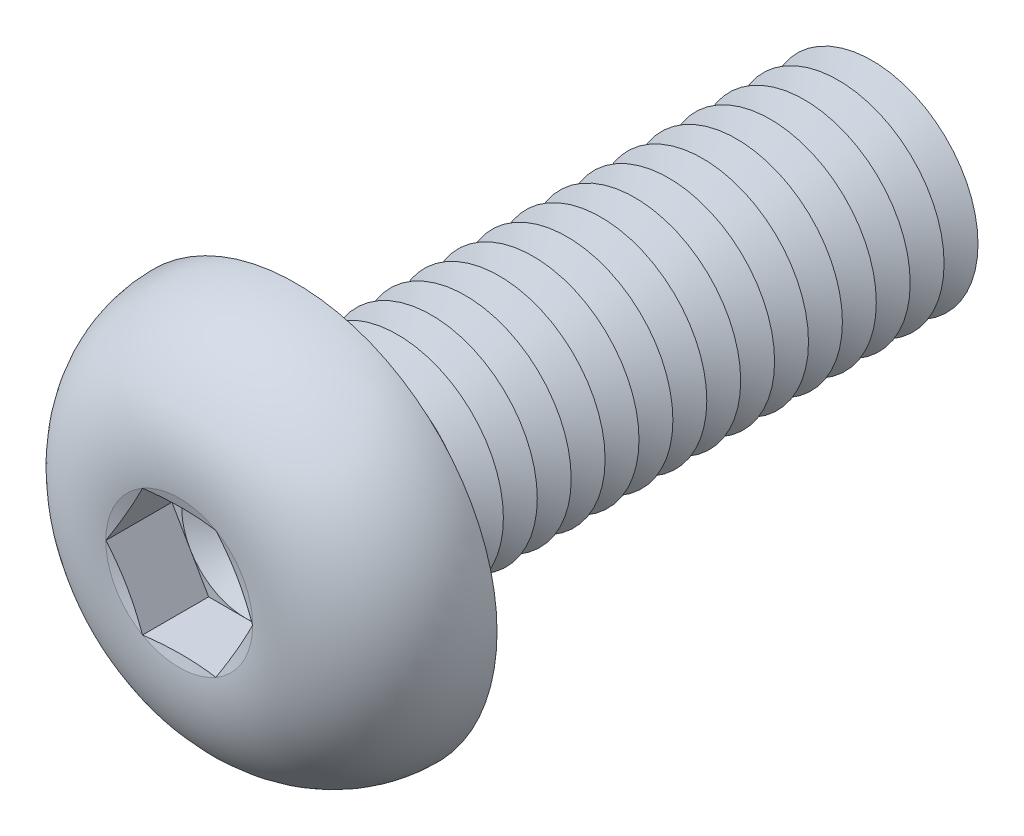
ISO-10303-21;
HEADER;
FILE_DESCRIPTION(('STEP AP214'),'2;1');
FILE_NAME('part.step','',(''),(''),'','','');
FILE_SCHEMA(('AUTOMOTIVE_DESIGN { 1 0 10303 214 1 1 1 1 }'));
ENDSEC;
DATA;
#1=APPLICATION_CONTEXT('core data for automotive mechanical design processes');
#2=APPLICATION_PROTOCOL_DEFINITION('international standard','automotive_design',2000,#1);
#3=PRODUCT_CONTEXT('',#1,'mechanical');
#4=PRODUCT('Part','Part','',(#3));
#5=PRODUCT_RELATED_PRODUCT_CATEGORY('part','',(#4));
#6=PRODUCT_DEFINITION_FORMATION('','',#4);
#7=PRODUCT_DEFINITION_CONTEXT('part definition',#1,'design');
#8=PRODUCT_DEFINITION('design','',#6,#7);
#9=PRODUCT_DEFINITION_SHAPE('','',#8);
#10=(LENGTH_UNIT() NAMED_UNIT(*) SI_UNIT(.MILLI.,.METRE.));
#11=(NAMED_UNIT(*) PLANE_ANGLE_UNIT() SI_UNIT($,.RADIAN.));
#12=(NAMED_UNIT(*) SI_UNIT($,.STERADIAN.) SOLID_ANGLE_UNIT());
#13=UNCERTAINTY_MEASURE_WITH_UNIT(LENGTH_MEASURE(1.E-05),#10,'distance_accuracy_value','');
#14=(GEOMETRIC_REPRESENTATION_CONTEXT(3) GLOBAL_UNCERTAINTY_ASSIGNED_CONTEXT((#13)) GLOBAL_UNIT_ASSIGNED_CONTEXT((#10,
#11,#12)) REPRESENTATION_CONTEXT('',''));
#15=CARTESIAN_POINT('',(0.,0.,0.));
#16=DIRECTION('',(0.,0.,1.));
#17=DIRECTION('',(1.,0.,0.));
#18=AXIS2_PLACEMENT_3D('',#15,#16,#17);
#19=CARTESIAN_POINT('',(0.,0.,1.19));
#20=DIRECTION('',(0.,0.,1.));
#21=DIRECTION('',(1.,0.,0.));
#22=AXIS2_PLACEMENT_3D('',#19,#20,#21);
#23=PLANE('',#22);
#24=CARTESIAN_POINT('',(0.,0.,1.19));
#25=DIRECTION('',(0.,0.,1.));
#26=DIRECTION('',(1.,0.,0.));
#27=AXIS2_PLACEMENT_3D('',#24,#25,#26);
#28=CIRCLE('',#27,1.49999930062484);
#29=CARTESIAN_POINT('',(1.2990375,0.749999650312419,1.19));
#30=VERTEX_POINT('',#29);
#31=CARTESIAN_POINT('',(0.,1.49999930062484,1.19));
#32=VERTEX_POINT('',#31);
#33=EDGE_CURVE('E118',#30,#32,#28,.T.);
#34=ORIENTED_EDGE('',*,*,#33,.F.);
#35=DIRECTION('',(-0.5,0.866025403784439,0.));
#36=VECTOR('',#35,1.);
#37=CARTESIAN_POINT('',(1.73205,0.,1.19));
#38=LINE('',#37,#36);
#39=CARTESIAN_POINT('',(0.866025,1.49999930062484,1.19));
#40=VERTEX_POINT('',#39);
#41=EDGE_CURVE('E125',#30,#40,#38,.T.);
#42=ORIENTED_EDGE('',*,*,#41,.T.);
#43=DIRECTION('',(-1.,0.,0.));
#44=VECTOR('',#43,1.);
#45=CARTESIAN_POINT('',(0.866025,1.49999930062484,1.19));
#46=LINE('',#45,#44);
#47=EDGE_CURVE('E136',#40,#32,#46,.T.);
#48=ORIENTED_EDGE('',*,*,#47,.T.);
#49=EDGE_LOOP('',(#34,#42,#48));
#50=FACE_BOUND('',#49,.T.);
#51=ADVANCED_FACE('F39',(#50),#23,.T.);
#52=CARTESIAN_POINT('',(0.,0.,1.19));
#53=DIRECTION('',(0.,0.,1.));
#54=DIRECTION('',(1.,0.,0.));
#55=AXIS2_PLACEMENT_3D('',#52,#53,#54);
#56=CIRCLE('',#55,1.49999930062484);
#57=CARTESIAN_POINT('',(-1.2990375,0.749999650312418,1.19));
#58=VERTEX_POINT('',#57);
#59=EDGE_CURVE('E11',#32,#58,#56,.T.);
#60=ORIENTED_EDGE('',*,*,#59,.F.);
#61=CARTESIAN_POINT('',(-0.866025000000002,1.49999930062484,1.19));
#62=VERTEX_POINT('',#61);
#63=EDGE_CURVE('E131',#32,#62,#46,.T.);
#64=ORIENTED_EDGE('',*,*,#63,.T.);
#65=DIRECTION('',(-0.5,-0.866025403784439,0.));
#66=VECTOR('',#65,1.);
#67=CARTESIAN_POINT('',(-0.866025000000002,1.49999930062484,1.19));
#68=LINE('',#67,#66);
#69=EDGE_CURVE('E134',#62,#58,#68,.T.);
#70=ORIENTED_EDGE('',*,*,#69,.T.);
#71=EDGE_LOOP('',(#60,#64,#70));
#72=FACE_BOUND('',#71,.T.);
#73=ADVANCED_FACE('F130',(#72),#23,.T.);
#74=CARTESIAN_POINT('',(-1.2990375,-0.749999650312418,1.19));
#75=VERTEX_POINT('',#74);
#76=EDGE_CURVE('E49',#58,#75,#56,.T.);
#77=ORIENTED_EDGE('',*,*,#76,.F.);
#78=CARTESIAN_POINT('',(-1.73205,0.,1.19));
#79=VERTEX_POINT('',#78);
#80=EDGE_CURVE('E143',#58,#79,#68,.T.);
#81=ORIENTED_EDGE('',*,*,#80,.T.);
#82=DIRECTION('',(0.5,-0.866025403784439,0.));
#83=VECTOR('',#82,1.);
#84=CARTESIAN_POINT('',(-1.73205,0.,1.19));
#85=LINE('',#84,#83);
#86=EDGE_CURVE('E151',#79,#75,#85,.T.);
#87=ORIENTED_EDGE('',*,*,#86,.T.);
#88=EDGE_LOOP('',(#77,#81,#87));
#89=FACE_BOUND('',#88,.T.);
#90=ADVANCED_FACE('F408',(#89),#23,.T.);
#91=CARTESIAN_POINT('',(0.,-1.49999930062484,1.19));
#92=VERTEX_POINT('',#91);
#93=EDGE_CURVE('E391',#75,#92,#56,.T.);
#94=ORIENTED_EDGE('',*,*,#93,.F.);
#95=CARTESIAN_POINT('',(-0.866025,-1.49999930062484,1.19));
#96=VERTEX_POINT('',#95);
#97=EDGE_CURVE('E150',#75,#96,#85,.T.);
#98=ORIENTED_EDGE('',*,*,#97,.T.);
#99=DIRECTION('',(1.,0.,0.));
#100=VECTOR('',#99,1.);
#101=CARTESIAN_POINT('',(-0.866025,-1.49999930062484,1.19));
#102=LINE('',#101,#100);
#103=EDGE_CURVE('E156',#96,#92,#102,.T.);
#104=ORIENTED_EDGE('',*,*,#103,.T.);
#105=EDGE_LOOP('',(#94,#98,#104));
#106=FACE_BOUND('',#105,.T.);
#107=ADVANCED_FACE('F401',(#106),#23,.T.);
#108=CARTESIAN_POINT('',(1.2990375,-0.749999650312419,1.19));
#109=VERTEX_POINT('',#108);
#110=EDGE_CURVE('E56',#92,#109,#56,.T.);
#111=ORIENTED_EDGE('',*,*,#110,.F.);
#112=CARTESIAN_POINT('',(0.866025,-1.49999930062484,1.19));
#113=VERTEX_POINT('',#112);
#114=EDGE_CURVE('E155',#92,#113,#102,.T.);
#115=ORIENTED_EDGE('',*,*,#114,.T.);
#116=DIRECTION('',(0.5,0.866025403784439,0.));
#117=VECTOR('',#116,1.);
#118=CARTESIAN_POINT('',(0.866025,-1.49999930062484,1.19));
#119=LINE('',#118,#117);
#120=EDGE_CURVE('E161',#113,#109,#119,.T.);
#121=ORIENTED_EDGE('',*,*,#120,.T.);
#122=EDGE_LOOP('',(#111,#115,#121));
#123=FACE_BOUND('',#122,.T.);
#124=ADVANCED_FACE('F480',(#123),#23,.T.);
#125=CARTESIAN_POINT('',(0.,0.,2.75));
#126=DIRECTION('',(0.,0.,1.));
#127=DIRECTION('',(1.,0.,0.));
#128=AXIS2_PLACEMENT_3D('',#125,#126,#127);
#129=CONICAL_SURFACE('',#128,1.73205,1.30899693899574);
#130=CARTESIAN_POINT('',(1.73216547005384,-0.000200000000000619,2.75003094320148));
#131=CARTESIAN_POINT('',(1.69619207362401,0.0621077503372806,2.74038633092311));
#132=CARTESIAN_POINT('',(1.66015343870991,0.124528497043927,2.73163050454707));
#133=CARTESIAN_POINT('',(1.58794885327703,0.249590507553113,2.71624720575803));
#134=CARTESIAN_POINT('',(1.5517828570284,0.312231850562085,2.70962059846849));
#135=CARTESIAN_POINT('',(1.47954289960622,0.437355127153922,2.69888271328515));
#136=CARTESIAN_POINT('',(1.4434694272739,0.499836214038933,2.69475862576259));
#137=CARTESIAN_POINT('',(1.37127646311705,0.624878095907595,2.68922863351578));
#138=CARTESIAN_POINT('',(1.33515698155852,0.687438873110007,2.68782220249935));
#139=CARTESIAN_POINT('',(1.26291801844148,0.812560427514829,2.68782220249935));
#140=CARTESIAN_POINT('',(1.22679853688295,0.87512120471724,2.68922863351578));
#141=CARTESIAN_POINT('',(1.1546055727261,1.0001630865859,2.69475862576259));
#142=CARTESIAN_POINT('',(1.11853210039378,1.06264417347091,2.69888271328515));
#143=CARTESIAN_POINT('',(1.0462921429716,1.18776745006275,2.70962059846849));
#144=CARTESIAN_POINT('',(1.01012614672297,1.25040879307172,2.71624720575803));
#145=CARTESIAN_POINT('',(0.937921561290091,1.37547080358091,2.73163050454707));
#146=CARTESIAN_POINT('',(0.901882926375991,1.43789155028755,2.74038633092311));
#147=CARTESIAN_POINT('',(0.865909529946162,1.50019930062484,2.75003094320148));
#148=B_SPLINE_CURVE_WITH_KNOTS('',3,(#130,#131,#132,#133,#134,#135,#136,#137,#138,#139,#140,
#141,#142,#143,#144,#145,#146,#147),.UNSPECIFIED.,.F.,.F.,(4,2,2,2,2,2,2,2,4),(0.,
0.217782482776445,0.435653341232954,0.652399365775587,0.869103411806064,1.08580745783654,
1.30255348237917,1.52042434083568,1.73820682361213),.UNSPECIFIED.);
#149=CARTESIAN_POINT('',(1.73205,0.,2.75));
#150=VERTEX_POINT('',#149);
#151=CARTESIAN_POINT('',(0.866025,1.49999930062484,2.75));
#152=VERTEX_POINT('',#151);
#153=EDGE_CURVE('E221',#150,#152,#148,.T.);
#154=ORIENTED_EDGE('',*,*,#153,.F.);
#155=CARTESIAN_POINT('',(0.,0.,2.75));
#156=DIRECTION('',(0.,0.,-1.));
#157=DIRECTION('',(-1.,0.,0.));
#158=AXIS2_PLACEMENT_3D('',#155,#156,#157);
#159=CIRCLE('',#158,1.73205);
#160=EDGE_CURVE('E439',#152,#150,#159,.T.);
#161=ORIENTED_EDGE('',*,*,#160,.F.);
#162=EDGE_LOOP('',(#154,#161));
#163=FACE_BOUND('',#162,.T.);
#164=ADVANCED_FACE('F484',(#163),#129,.F.);
#165=CARTESIAN_POINT('',(0.865909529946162,-1.50019930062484,2.75003094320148));
#166=CARTESIAN_POINT('',(0.901882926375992,-1.43789155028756,2.74038633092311));
#167=CARTESIAN_POINT('',(0.937921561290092,-1.37547080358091,2.73163050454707));
#168=CARTESIAN_POINT('',(1.01012614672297,-1.25040879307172,2.71624720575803));
#169=CARTESIAN_POINT('',(1.0462921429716,-1.18776745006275,2.70962059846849));
#170=CARTESIAN_POINT('',(1.11853210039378,-1.06264417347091,2.69888271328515));
#171=CARTESIAN_POINT('',(1.1546055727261,-1.0001630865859,2.69475862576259));
#172=CARTESIAN_POINT('',(1.22679853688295,-0.875121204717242,2.68922863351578));
#173=CARTESIAN_POINT('',(1.26291801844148,-0.81256042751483,2.68782220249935));
#174=CARTESIAN_POINT('',(1.33515698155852,-0.687438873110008,2.68782220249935));
#175=CARTESIAN_POINT('',(1.37127646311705,-0.624878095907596,2.68922863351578));
#176=CARTESIAN_POINT('',(1.4434694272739,-0.499836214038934,2.69475862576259));
#177=CARTESIAN_POINT('',(1.47954289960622,-0.437355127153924,2.69888271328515));
#178=CARTESIAN_POINT('',(1.5517828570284,-0.312231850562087,2.70962059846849));
#179=CARTESIAN_POINT('',(1.58794885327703,-0.249590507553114,2.71624720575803));
#180=CARTESIAN_POINT('',(1.66015343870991,-0.124528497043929,2.73163050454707));
#181=CARTESIAN_POINT('',(1.69619207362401,-0.062107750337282,2.74038633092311));
#182=CARTESIAN_POINT('',(1.73216547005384,0.000199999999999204,2.75003094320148));
#183=B_SPLINE_CURVE_WITH_KNOTS('',3,(#165,#166,#167,#168,#169,#170,#171,#172,#173,#174,#175,
#176,#177,#178,#179,#180,#181,#182),.UNSPECIFIED.,.F.,.F.,(4,2,2,2,2,2,2,2,4),(0.,
0.217782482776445,0.435653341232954,0.652399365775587,0.869103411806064,1.08580745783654,
1.30255348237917,1.52042434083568,1.73820682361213),.UNSPECIFIED.);
#184=CARTESIAN_POINT('',(0.866025,-1.49999930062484,2.75));
#185=VERTEX_POINT('',#184);
#186=EDGE_CURVE('E230',#185,#150,#183,.T.);
#187=ORIENTED_EDGE('',*,*,#186,.F.);
#188=EDGE_CURVE('E441',#150,#185,#159,.T.);
#189=ORIENTED_EDGE('',*,*,#188,.F.);
#190=EDGE_LOOP('',(#187,#189));
#191=FACE_BOUND('',#190,.T.);
#192=ADVANCED_FACE('F446',(#191),#129,.F.);
#193=CARTESIAN_POINT('',(-2.61375031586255,-1.49999930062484,3.09338600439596));
#194=CARTESIAN_POINT('',(-2.48719895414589,-1.49999930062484,3.06401688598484));
#195=CARTESIAN_POINT('',(-2.36054180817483,-1.49999930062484,3.03507426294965));
#196=CARTESIAN_POINT('',(-2.10688190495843,-1.49999930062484,2.97862489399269));
#197=CARTESIAN_POINT('',(-1.97987908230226,-1.49999930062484,2.95111844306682));
#198=CARTESIAN_POINT('',(-1.72425281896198,-1.49999930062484,2.89788845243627));
#199=CARTESIAN_POINT('',(-1.59562534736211,-1.49999930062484,2.87218404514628));
#200=CARTESIAN_POINT('',(-1.33776732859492,-1.49999930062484,2.82387586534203));
#201=CARTESIAN_POINT('',(-1.20853672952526,-1.49999930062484,2.80127236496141));
#202=CARTESIAN_POINT('',(-0.952831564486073,-1.49999930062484,2.76126658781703));
#203=CARTESIAN_POINT('',(-0.826376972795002,-1.49999930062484,2.74374018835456));
#204=CARTESIAN_POINT('',(-0.572755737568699,-1.49999930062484,2.71502809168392));
#205=CARTESIAN_POINT('',(-0.44558933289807,-1.49999930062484,2.70384038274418));
#206=CARTESIAN_POINT('',(-0.191333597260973,-1.49999930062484,2.68972083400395));
#207=CARTESIAN_POINT('',(-0.0642464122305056,-1.49999930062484,2.68675270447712));
#208=CARTESIAN_POINT('',(0.189835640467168,-1.49999930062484,2.68959577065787));
#209=CARTESIAN_POINT('',(0.316830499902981,-1.49999930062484,2.69540767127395));
#210=CARTESIAN_POINT('',(0.534182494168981,-1.49999930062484,2.71190493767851));
#211=CARTESIAN_POINT('',(0.624691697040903,-1.49999930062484,2.72073513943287));
#212=CARTESIAN_POINT('',(0.805336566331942,-1.49999930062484,2.74156379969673));
#213=CARTESIAN_POINT('',(0.895472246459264,-1.49999930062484,2.75356214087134));
#214=CARTESIAN_POINT('',(1.0756572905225,-1.49999930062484,2.78006977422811));
#215=CARTESIAN_POINT('',(1.16570548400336,-1.49999930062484,2.7945868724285));
#216=CARTESIAN_POINT('',(1.3454787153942,-1.49999930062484,2.82550612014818));
#217=CARTESIAN_POINT('',(1.43520373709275,-1.49999930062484,2.8419083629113));
#218=CARTESIAN_POINT('',(1.61622412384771,-1.49999930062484,2.87648604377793));
#219=CARTESIAN_POINT('',(1.70751379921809,-1.49999930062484,2.89469103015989));
#220=CARTESIAN_POINT('',(1.88986344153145,-1.49999930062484,2.93221618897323));
#221=CARTESIAN_POINT('',(1.98092340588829,-1.49999930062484,2.95153637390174));
#222=CARTESIAN_POINT('',(2.16236354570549,-1.49999930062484,2.99091506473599));
#223=CARTESIAN_POINT('',(2.25274472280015,-1.49999930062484,3.01096897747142));
#224=CARTESIAN_POINT('',(2.43335289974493,-1.49999930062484,3.05173139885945));
#225=CARTESIAN_POINT('',(2.52357990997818,-1.49999930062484,3.07243986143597));
#226=CARTESIAN_POINT('',(2.61375031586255,-1.49999930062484,3.09338600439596));
#227=B_SPLINE_CURVE_WITH_KNOTS('',3,(#193,#194,#195,#196,#197,#198,#199,#200,#201,#202,#203,
#204,#205,#206,#207,#208,#209,#210,#211,#212,#213,#214,#215,#216,#217,#218,#219,#220,#221,#222,
#223,#224,#225,#226),.UNSPECIFIED.,.F.,.F.,(4,2,2,2,2,2,2,2,2,2,2,2,2,2,2,2,4),(0.,
0.389753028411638,0.779585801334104,1.17307326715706,1.5665952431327,1.94947555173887,
2.33223427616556,2.71330039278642,3.09439710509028,3.36715350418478,3.63989980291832,
3.91350699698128,4.18712773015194,4.46638029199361,4.74563598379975,5.02337106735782,
5.3010866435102),.UNSPECIFIED.);
#228=CARTESIAN_POINT('',(-0.866025,-1.49999930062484,2.75));
#229=VERTEX_POINT('',#228);
#230=EDGE_CURVE('E420',#229,#185,#227,.T.);
#231=ORIENTED_EDGE('',*,*,#230,.F.);
#232=EDGE_CURVE('E428',#185,#229,#159,.T.);
#233=ORIENTED_EDGE('',*,*,#232,.F.);
#234=EDGE_LOOP('',(#231,#233));
#235=FACE_BOUND('',#234,.T.);
#236=ADVANCED_FACE('F451',(#235),#129,.F.);
#237=CARTESIAN_POINT('',(-1.73216547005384,0.000200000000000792,2.75003094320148));
#238=CARTESIAN_POINT('',(-1.69619207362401,-0.0621077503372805,2.74038633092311));
#239=CARTESIAN_POINT('',(-1.66015343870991,-0.124528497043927,2.73163050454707));
#240=CARTESIAN_POINT('',(-1.58794885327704,-0.249590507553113,2.71624720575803));
#241=CARTESIAN_POINT('',(-1.55178285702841,-0.312231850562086,2.70962059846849));
#242=CARTESIAN_POINT('',(-1.47954289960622,-0.437355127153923,2.69888271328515));
#243=CARTESIAN_POINT('',(-1.4434694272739,-0.499836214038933,2.69475862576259));
#244=CARTESIAN_POINT('',(-1.37127646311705,-0.624878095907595,2.68922863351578));
#245=CARTESIAN_POINT('',(-1.33515698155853,-0.687438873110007,2.68782220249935));
#246=CARTESIAN_POINT('',(-1.26291801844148,-0.81256042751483,2.68782220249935));
#247=CARTESIAN_POINT('',(-1.22679853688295,-0.875121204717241,2.68922863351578));
#248=CARTESIAN_POINT('',(-1.1546055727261,-1.0001630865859,2.69475862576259));
#249=CARTESIAN_POINT('',(-1.11853210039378,-1.06264417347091,2.69888271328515));
#250=CARTESIAN_POINT('',(-1.0462921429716,-1.18776745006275,2.70962059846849));
#251=CARTESIAN_POINT('',(-1.01012614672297,-1.25040879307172,2.71624720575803));
#252=CARTESIAN_POINT('',(-0.937921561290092,-1.37547080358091,2.73163050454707));
#253=CARTESIAN_POINT('',(-0.901882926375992,-1.43789155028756,2.74038633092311));
#254=CARTESIAN_POINT('',(-0.865909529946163,-1.50019930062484,2.75003094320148));
#255=B_SPLINE_CURVE_WITH_KNOTS('',3,(#237,#238,#239,#240,#241,#242,#243,#244,#245,#246,#247,
#248,#249,#250,#251,#252,#253,#254),.UNSPECIFIED.,.F.,.F.,(4,2,2,2,2,2,2,2,4),(0.,
0.217782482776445,0.435653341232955,0.652399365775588,0.869103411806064,1.08580745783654,
1.30255348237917,1.52042434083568,1.73820682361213),.UNSPECIFIED.);
#256=CARTESIAN_POINT('',(-1.73205,0.,2.75));
#257=VERTEX_POINT('',#256);
#258=EDGE_CURVE('E413',#257,#229,#255,.T.);
#259=ORIENTED_EDGE('',*,*,#258,.F.);
#260=EDGE_CURVE('E371',#229,#257,#159,.T.);
#261=ORIENTED_EDGE('',*,*,#260,.F.);
#262=EDGE_LOOP('',(#259,#261));
#263=FACE_BOUND('',#262,.T.);
#264=ADVANCED_FACE('F417',(#263),#129,.F.);
#265=CARTESIAN_POINT('',(-0.865909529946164,1.50019930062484,2.75003094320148));
#266=CARTESIAN_POINT('',(-0.901882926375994,1.43789155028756,2.74038633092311));
#267=CARTESIAN_POINT('',(-0.937921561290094,1.37547080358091,2.73163050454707));
#268=CARTESIAN_POINT('',(-1.01012614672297,1.25040879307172,2.71624720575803));
#269=CARTESIAN_POINT('',(-1.0462921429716,1.18776745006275,2.70962059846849));
#270=CARTESIAN_POINT('',(-1.11853210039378,1.06264417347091,2.69888271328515));
#271=CARTESIAN_POINT('',(-1.1546055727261,1.0001630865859,2.69475862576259));
#272=CARTESIAN_POINT('',(-1.22679853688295,0.875121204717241,2.68922863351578));
#273=CARTESIAN_POINT('',(-1.26291801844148,0.81256042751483,2.68782220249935));
#274=CARTESIAN_POINT('',(-1.33515698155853,0.687438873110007,2.68782220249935));
#275=CARTESIAN_POINT('',(-1.37127646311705,0.624878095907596,2.68922863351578));
#276=CARTESIAN_POINT('',(-1.4434694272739,0.499836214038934,2.69475862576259));
#277=CARTESIAN_POINT('',(-1.47954289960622,0.437355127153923,2.69888271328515));
#278=CARTESIAN_POINT('',(-1.55178285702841,0.312231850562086,2.70962059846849));
#279=CARTESIAN_POINT('',(-1.58794885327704,0.249590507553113,2.71624720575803));
#280=CARTESIAN_POINT('',(-1.66015343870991,0.124528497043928,2.73163050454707));
#281=CARTESIAN_POINT('',(-1.69619207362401,0.0621077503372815,2.74038633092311));
#282=CARTESIAN_POINT('',(-1.73216547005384,-0.000199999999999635,2.75003094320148));
#283=B_SPLINE_CURVE_WITH_KNOTS('',3,(#265,#266,#267,#268,#269,#270,#271,#272,#273,#274,#275,
#276,#277,#278,#279,#280,#281,#282),.UNSPECIFIED.,.F.,.F.,(4,2,2,2,2,2,2,2,4),(0.,
0.217782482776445,0.435653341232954,0.652399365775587,0.869103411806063,1.08580745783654,
1.30255348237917,1.52042434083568,1.73820682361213),.UNSPECIFIED.);
#284=CARTESIAN_POINT('',(-0.866025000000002,1.49999930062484,2.75));
#285=VERTEX_POINT('',#284);
#286=EDGE_CURVE('E194',#285,#257,#283,.T.);
#287=ORIENTED_EDGE('',*,*,#286,.F.);
#288=EDGE_CURVE('E372',#257,#285,#159,.T.);
#289=ORIENTED_EDGE('',*,*,#288,.F.);
#290=EDGE_LOOP('',(#287,#289));
#291=FACE_BOUND('',#290,.T.);
#292=ADVANCED_FACE('F431',(#291),#129,.F.);
#293=CARTESIAN_POINT('',(0.,0.,-11.2));
#294=DIRECTION('',(0.,0.,1.));
#295=DIRECTION('',(1.,0.,0.));
#296=AXIS2_PLACEMENT_3D('',#293,#294,#295);
#297=CONICAL_SURFACE('',#296,2.5,1.0471975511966);
#298=CARTESIAN_POINT('',(0.,0.,-11.6));
#299=DIRECTION('',(0.,0.,1.));
#300=DIRECTION('',(1.,0.,0.));
#301=AXIS2_PLACEMENT_3D('',#298,#299,#300);
#302=CIRCLE('',#301,1.80717967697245);
#303=CARTESIAN_POINT('',(1.80717967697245,0.,-11.6));
#304=VERTEX_POINT('',#303);
#305=EDGE_CURVE('E343',#304,#304,#302,.T.);
#306=ORIENTED_EDGE('',*,*,#305,.T.);
#307=EDGE_LOOP('',(#306));
#308=FACE_BOUND('',#307,.T.);
#309=CARTESIAN_POINT('',(0.,0.,-11.2));
#310=DIRECTION('',(0.,0.,1.));
#311=DIRECTION('',(1.,0.,0.));
#312=AXIS2_PLACEMENT_3D('',#309,#310,#311);
#313=CIRCLE('',#312,2.5);
#314=CARTESIAN_POINT('',(2.5,0.,-11.2));
#315=VERTEX_POINT('',#314);
#316=EDGE_CURVE('E339',#315,#315,#313,.T.);
#317=ORIENTED_EDGE('',*,*,#316,.F.);
#318=EDGE_LOOP('',(#317));
#319=FACE_BOUND('',#318,.T.);
#320=ADVANCED_FACE('F619',(#308,#319),#297,.T.);
#321=CARTESIAN_POINT('',(0.,0.,-11.6));
#322=DIRECTION('',(0.,0.,-1.));
#323=DIRECTION('',(-1.,0.,0.));
#324=AXIS2_PLACEMENT_3D('',#321,#322,#323);
#325=CONICAL_SURFACE('',#324,1.80717967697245,1.0471975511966);
#326=CARTESIAN_POINT('',(0.,0.,-12.));
#327=DIRECTION('',(0.,0.,1.));
#328=DIRECTION('',(1.,0.,0.));
#329=AXIS2_PLACEMENT_3D('',#326,#327,#328);
#330=CIRCLE('',#329,2.5);
#331=CARTESIAN_POINT('',(2.5,0.,-12.));
#332=VERTEX_POINT('',#331);
#333=EDGE_CURVE('E347',#332,#332,#330,.T.);
#334=ORIENTED_EDGE('',*,*,#333,.T.);
#335=EDGE_LOOP('',(#334));
#336=FACE_BOUND('',#335,.T.);
#337=ORIENTED_EDGE('',*,*,#305,.F.);
#338=EDGE_LOOP('',(#337));
#339=FACE_BOUND('',#338,.T.);
#340=ADVANCED_FACE('F922',(#336,#339),#325,.T.);
#341=CARTESIAN_POINT('',(0.,2.50000000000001,-14.));
#342=DIRECTION('',(0.,0.,-1.));
#343=DIRECTION('',(-1.,0.,0.));
#344=AXIS2_PLACEMENT_3D('',#341,#342,#343);
#345=PLANE('',#344);
#346=CARTESIAN_POINT('',(0.,0.,-14.));
#347=DIRECTION('',(0.,0.,1.));
#348=DIRECTION('',(1.,0.,0.));
#349=AXIS2_PLACEMENT_3D('',#346,#347,#348);
#350=CIRCLE('',#349,1.80717967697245);
#351=CARTESIAN_POINT('',(1.80717967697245,0.,-14.));
#352=VERTEX_POINT('',#351);
#353=EDGE_CURVE('E367',#352,#352,#350,.T.);
#354=ORIENTED_EDGE('',*,*,#353,.F.);
#355=EDGE_LOOP('',(#354));
#356=FACE_BOUND('',#355,.T.);
#357=ADVANCED_FACE('F927',(#356),#345,.T.);
#358=CARTESIAN_POINT('',(0.,0.,-13.6));
#359=DIRECTION('',(0.,0.,1.));
#360=DIRECTION('',(1.,0.,0.));
#361=AXIS2_PLACEMENT_3D('',#358,#359,#360);
#362=CONICAL_SURFACE('',#361,2.5,1.0471975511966);
#363=ORIENTED_EDGE('',*,*,#353,.T.);
#364=EDGE_LOOP('',(#363));
#365=FACE_BOUND('',#364,.T.);
#366=CARTESIAN_POINT('',(0.,0.,-13.6));
#367=DIRECTION('',(0.,0.,1.));
#368=DIRECTION('',(1.,0.,0.));
#369=AXIS2_PLACEMENT_3D('',#366,#367,#368);
#370=CIRCLE('',#369,2.5);
#371=CARTESIAN_POINT('',(2.5,0.,-13.6));
#372=VERTEX_POINT('',#371);
#373=EDGE_CURVE('E363',#372,#372,#370,.T.);
#374=ORIENTED_EDGE('',*,*,#373,.F.);
#375=EDGE_LOOP('',(#374));
#376=FACE_BOUND('',#375,.T.);
#377=ADVANCED_FACE('F916',(#365,#376),#362,.T.);
#378=CARTESIAN_POINT('',(0.,0.,-13.2));
#379=DIRECTION('',(0.,0.,-1.));
#380=DIRECTION('',(-1.,0.,0.));
#381=AXIS2_PLACEMENT_3D('',#378,#379,#380);
#382=CONICAL_SURFACE('',#381,1.80717967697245,1.0471975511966);
#383=ORIENTED_EDGE('',*,*,#373,.T.);
#384=EDGE_LOOP('',(#383));
#385=FACE_BOUND('',#384,.T.);
#386=CARTESIAN_POINT('',(0.,0.,-13.2));
#387=DIRECTION('',(0.,0.,1.));
#388=DIRECTION('',(1.,0.,0.));
#389=AXIS2_PLACEMENT_3D('',#386,#387,#388);
#390=CIRCLE('',#389,1.80717967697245);
#391=CARTESIAN_POINT('',(1.80717967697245,0.,-13.2));
#392=VERTEX_POINT('',#391);
#393=EDGE_CURVE('E359',#392,#392,#390,.T.);
#394=ORIENTED_EDGE('',*,*,#393,.F.);
#395=EDGE_LOOP('',(#394));
#396=FACE_BOUND('',#395,.T.);
#397=ADVANCED_FACE('F906',(#385,#396),#382,.T.);
#398=CARTESIAN_POINT('',(0.,0.,-12.8));
#399=DIRECTION('',(0.,0.,1.));
#400=DIRECTION('',(1.,0.,0.));
#401=AXIS2_PLACEMENT_3D('',#398,#399,#400);
#402=CONICAL_SURFACE('',#401,2.5,1.0471975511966);
#403=ORIENTED_EDGE('',*,*,#393,.T.);
#404=EDGE_LOOP('',(#403));
#405=FACE_BOUND('',#404,.T.);
#406=CARTESIAN_POINT('',(0.,0.,-12.8));
#407=DIRECTION('',(0.,0.,1.));
#408=DIRECTION('',(1.,0.,0.));
#409=AXIS2_PLACEMENT_3D('',#406,#407,#408);
#410=CIRCLE('',#409,2.5);
#411=CARTESIAN_POINT('',(2.5,0.,-12.8));
#412=VERTEX_POINT('',#411);
#413=EDGE_CURVE('E355',#412,#412,#410,.T.);
#414=ORIENTED_EDGE('',*,*,#413,.F.);
#415=EDGE_LOOP('',(#414));
#416=FACE_BOUND('',#415,.T.);
#417=ADVANCED_FACE('F896',(#405,#416),#402,.T.);
#418=CARTESIAN_POINT('',(0.,0.,-12.4));
#419=DIRECTION('',(0.,0.,-1.));
#420=DIRECTION('',(-1.,0.,0.));
#421=AXIS2_PLACEMENT_3D('',#418,#419,#420);
#422=CONICAL_SURFACE('',#421,1.80717967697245,1.0471975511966);
#423=ORIENTED_EDGE('',*,*,#413,.T.);
#424=EDGE_LOOP('',(#423));
#425=FACE_BOUND('',#424,.T.);
#426=CARTESIAN_POINT('',(0.,0.,-12.4));
#427=DIRECTION('',(0.,0.,1.));
#428=DIRECTION('',(1.,0.,0.));
#429=AXIS2_PLACEMENT_3D('',#426,#427,#428);
#430=CIRCLE('',#429,1.80717967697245);
#431=CARTESIAN_POINT('',(1.80717967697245,0.,-12.4));
#432=VERTEX_POINT('',#431);
#433=EDGE_CURVE('E351',#432,#432,#430,.T.);
#434=ORIENTED_EDGE('',*,*,#433,.F.);
#435=EDGE_LOOP('',(#434));
#436=FACE_BOUND('',#435,.T.);
#437=ADVANCED_FACE('F886',(#425,#436),#422,.T.);
#438=CARTESIAN_POINT('',(0.,0.,-12.));
#439=DIRECTION('',(0.,0.,1.));
#440=DIRECTION('',(1.,0.,0.));
#441=AXIS2_PLACEMENT_3D('',#438,#439,#440);
#442=CONICAL_SURFACE('',#441,2.5,1.0471975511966);
#443=ORIENTED_EDGE('',*,*,#433,.T.);
#444=EDGE_LOOP('',(#443));
#445=FACE_BOUND('',#444,.T.);
#446=ORIENTED_EDGE('',*,*,#333,.F.);
#447=EDGE_LOOP('',(#446));
#448=FACE_BOUND('',#447,.T.);
#449=ADVANCED_FACE('F876',(#445,#448),#442,.T.);
#450=CARTESIAN_POINT('',(0.,0.,-10.4));
#451=DIRECTION('',(0.,0.,1.));
#452=DIRECTION('',(1.,0.,0.));
#453=AXIS2_PLACEMENT_3D('',#450,#451,#452);
#454=CONICAL_SURFACE('',#453,2.5,1.0471975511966);
#455=CARTESIAN_POINT('',(0.,0.,-10.8));
#456=DIRECTION('',(0.,0.,1.));
#457=DIRECTION('',(1.,0.,0.));
#458=AXIS2_PLACEMENT_3D('',#455,#456,#457);
#459=CIRCLE('',#458,1.80717967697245);
#460=CARTESIAN_POINT('',(1.80717967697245,0.,-10.8));
#461=VERTEX_POINT('',#460);
#462=EDGE_CURVE('E335',#461,#461,#459,.T.);
#463=ORIENTED_EDGE('',*,*,#462,.T.);
#464=EDGE_LOOP('',(#463));
#465=FACE_BOUND('',#464,.T.);
#466=CARTESIAN_POINT('',(0.,0.,-10.4));
#467=DIRECTION('',(0.,0.,1.));
#468=DIRECTION('',(1.,0.,0.));
#469=AXIS2_PLACEMENT_3D('',#466,#467,#468);
#470=CIRCLE('',#469,2.5);
#471=CARTESIAN_POINT('',(2.5,0.,-10.4));
#472=VERTEX_POINT('',#471);
#473=EDGE_CURVE('E331',#472,#472,#470,.T.);
#474=ORIENTED_EDGE('',*,*,#473,.F.);
#475=EDGE_LOOP('',(#474));
#476=FACE_BOUND('',#475,.T.);
#477=ADVANCED_FACE('F866',(#465,#476),#454,.T.);
#478=CARTESIAN_POINT('',(0.,0.,-10.8));
#479=DIRECTION('',(0.,0.,-1.));
#480=DIRECTION('',(-1.,0.,0.));
#481=AXIS2_PLACEMENT_3D('',#478,#479,#480);
#482=CONICAL_SURFACE('',#481,1.80717967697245,1.0471975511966);
#483=ORIENTED_EDGE('',*,*,#316,.T.);
#484=EDGE_LOOP('',(#483));
#485=FACE_BOUND('',#484,.T.);
#486=ORIENTED_EDGE('',*,*,#462,.F.);
#487=EDGE_LOOP('',(#486));
#488=FACE_BOUND('',#487,.T.);
#489=ADVANCED_FACE('F856',(#485,#488),#482,.T.);
#490=CARTESIAN_POINT('',(0.,0.,-9.6));
#491=DIRECTION('',(0.,0.,1.));
#492=DIRECTION('',(1.,0.,0.));
#493=AXIS2_PLACEMENT_3D('',#490,#491,#492);
#494=CONICAL_SURFACE('',#493,2.5,1.0471975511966);
#495=CARTESIAN_POINT('',(0.,0.,-10.));
#496=DIRECTION('',(0.,0.,1.));
#497=DIRECTION('',(1.,0.,0.));
#498=AXIS2_PLACEMENT_3D('',#495,#496,#497);
#499=CIRCLE('',#498,1.80717967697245);
#500=CARTESIAN_POINT('',(1.80717967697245,0.,-10.));
#501=VERTEX_POINT('',#500);
#502=EDGE_CURVE('E327',#501,#501,#499,.T.);
#503=ORIENTED_EDGE('',*,*,#502,.T.);
#504=EDGE_LOOP('',(#503));
#505=FACE_BOUND('',#504,.T.);
#506=CARTESIAN_POINT('',(0.,0.,-9.6));
#507=DIRECTION('',(0.,0.,1.));
#508=DIRECTION('',(1.,0.,0.));
#509=AXIS2_PLACEMENT_3D('',#506,#507,#508);
#510=CIRCLE('',#509,2.5);
#511=CARTESIAN_POINT('',(2.5,0.,-9.6));
#512=VERTEX_POINT('',#511);
#513=EDGE_CURVE('E323',#512,#512,#510,.T.);
#514=ORIENTED_EDGE('',*,*,#513,.F.);
#515=EDGE_LOOP('',(#514));
#516=FACE_BOUND('',#515,.T.);
#517=ADVANCED_FACE('F846',(#505,#516),#494,.T.);
#518=CARTESIAN_POINT('',(0.,0.,-10.));
#519=DIRECTION('',(0.,0.,-1.));
#520=DIRECTION('',(-1.,0.,0.));
#521=AXIS2_PLACEMENT_3D('',#518,#519,#520);
#522=CONICAL_SURFACE('',#521,1.80717967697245,1.0471975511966);
#523=ORIENTED_EDGE('',*,*,#473,.T.);
#524=EDGE_LOOP('',(#523));
#525=FACE_BOUND('',#524,.T.);
#526=ORIENTED_EDGE('',*,*,#502,.F.);
#527=EDGE_LOOP('',(#526));
#528=FACE_BOUND('',#527,.T.);
#529=ADVANCED_FACE('F836',(#525,#528),#522,.T.);
#530=CARTESIAN_POINT('',(0.,0.,-8.8));
#531=DIRECTION('',(0.,0.,1.));
#532=DIRECTION('',(1.,0.,0.));
#533=AXIS2_PLACEMENT_3D('',#530,#531,#532);
#534=CONICAL_SURFACE('',#533,2.5,1.0471975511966);
#535=CARTESIAN_POINT('',(0.,0.,-9.2));
#536=DIRECTION('',(0.,0.,1.));
#537=DIRECTION('',(1.,0.,0.));
#538=AXIS2_PLACEMENT_3D('',#535,#536,#537);
#539=CIRCLE('',#538,1.80717967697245);
#540=CARTESIAN_POINT('',(1.80717967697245,0.,-9.2));
#541=VERTEX_POINT('',#540);
#542=EDGE_CURVE('E319',#541,#541,#539,.T.);
#543=ORIENTED_EDGE('',*,*,#542,.T.);
#544=EDGE_LOOP('',(#543));
#545=FACE_BOUND('',#544,.T.);
#546=CARTESIAN_POINT('',(0.,0.,-8.8));
#547=DIRECTION('',(0.,0.,1.));
#548=DIRECTION('',(1.,0.,0.));
#549=AXIS2_PLACEMENT_3D('',#546,#547,#548);
#550=CIRCLE('',#549,2.5);
#551=CARTESIAN_POINT('',(2.5,0.,-8.8));
#552=VERTEX_POINT('',#551);
#553=EDGE_CURVE('E315',#552,#552,#550,.T.);
#554=ORIENTED_EDGE('',*,*,#553,.F.);
#555=EDGE_LOOP('',(#554));
#556=FACE_BOUND('',#555,.T.);
#557=ADVANCED_FACE('F826',(#545,#556),#534,.T.);
#558=CARTESIAN_POINT('',(0.,0.,-9.2));
#559=DIRECTION('',(0.,0.,-1.));
#560=DIRECTION('',(-1.,0.,0.));
#561=AXIS2_PLACEMENT_3D('',#558,#559,#560);
#562=CONICAL_SURFACE('',#561,1.80717967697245,1.0471975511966);
#563=ORIENTED_EDGE('',*,*,#513,.T.);
#564=EDGE_LOOP('',(#563));
#565=FACE_BOUND('',#564,.T.);
#566=ORIENTED_EDGE('',*,*,#542,.F.);
#567=EDGE_LOOP('',(#566));
#568=FACE_BOUND('',#567,.T.);
#569=ADVANCED_FACE('F816',(#565,#568),#562,.T.);
#570=CARTESIAN_POINT('',(0.,0.,-8.));
#571=DIRECTION('',(0.,0.,1.));
#572=DIRECTION('',(1.,0.,0.));
#573=AXIS2_PLACEMENT_3D('',#570,#571,#572);
#574=CONICAL_SURFACE('',#573,2.5,1.0471975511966);
#575=CARTESIAN_POINT('',(0.,0.,-8.4));
#576=DIRECTION('',(0.,0.,1.));
#577=DIRECTION('',(1.,0.,0.));
#578=AXIS2_PLACEMENT_3D('',#575,#576,#577);
#579=CIRCLE('',#578,1.80717967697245);
#580=CARTESIAN_POINT('',(1.80717967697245,0.,-8.4));
#581=VERTEX_POINT('',#580);
#582=EDGE_CURVE('E311',#581,#581,#579,.T.);
#583=ORIENTED_EDGE('',*,*,#582,.T.);
#584=EDGE_LOOP('',(#583));
#585=FACE_BOUND('',#584,.T.);
#586=CARTESIAN_POINT('',(0.,0.,-8.));
#587=DIRECTION('',(0.,0.,1.));
#588=DIRECTION('',(1.,0.,0.));
#589=AXIS2_PLACEMENT_3D('',#586,#587,#588);
#590=CIRCLE('',#589,2.5);
#591=CARTESIAN_POINT('',(2.5,0.,-8.));
#592=VERTEX_POINT('',#591);
#593=EDGE_CURVE('E307',#592,#592,#590,.T.);
#594=ORIENTED_EDGE('',*,*,#593,.F.);
#595=EDGE_LOOP('',(#594));
#596=FACE_BOUND('',#595,.T.);
#597=ADVANCED_FACE('F806',(#585,#596),#574,.T.);
#598=CARTESIAN_POINT('',(0.,0.,-8.4));
#599=DIRECTION('',(0.,0.,-1.));
#600=DIRECTION('',(-1.,0.,0.));
#601=AXIS2_PLACEMENT_3D('',#598,#599,#600);
#602=CONICAL_SURFACE('',#601,1.80717967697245,1.0471975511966);
#603=ORIENTED_EDGE('',*,*,#553,.T.);
#604=EDGE_LOOP('',(#603));
#605=FACE_BOUND('',#604,.T.);
#606=ORIENTED_EDGE('',*,*,#582,.F.);
#607=EDGE_LOOP('',(#606));
#608=FACE_BOUND('',#607,.T.);
#609=ADVANCED_FACE('F796',(#605,#608),#602,.T.);
#610=CARTESIAN_POINT('',(0.,0.,-7.2));
#611=DIRECTION('',(0.,0.,1.));
#612=DIRECTION('',(1.,0.,0.));
#613=AXIS2_PLACEMENT_3D('',#610,#611,#612);
#614=CONICAL_SURFACE('',#613,2.5,1.0471975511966);
#615=CARTESIAN_POINT('',(0.,0.,-7.6));
#616=DIRECTION('',(0.,0.,1.));
#617=DIRECTION('',(1.,0.,0.));
#618=AXIS2_PLACEMENT_3D('',#615,#616,#617);
#619=CIRCLE('',#618,1.80717967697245);
#620=CARTESIAN_POINT('',(1.80717967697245,0.,-7.6));
#621=VERTEX_POINT('',#620);
#622=EDGE_CURVE('E303',#621,#621,#619,.T.);
#623=ORIENTED_EDGE('',*,*,#622,.T.);
#624=EDGE_LOOP('',(#623));
#625=FACE_BOUND('',#624,.T.);
#626=CARTESIAN_POINT('',(0.,0.,-7.2));
#627=DIRECTION('',(0.,0.,1.));
#628=DIRECTION('',(1.,0.,0.));
#629=AXIS2_PLACEMENT_3D('',#626,#627,#628);
#630=CIRCLE('',#629,2.5);
#631=CARTESIAN_POINT('',(2.5,0.,-7.2));
#632=VERTEX_POINT('',#631);
#633=EDGE_CURVE('E299',#632,#632,#630,.T.);
#634=ORIENTED_EDGE('',*,*,#633,.F.);
#635=EDGE_LOOP('',(#634));
#636=FACE_BOUND('',#635,.T.);
#637=ADVANCED_FACE('F786',(#625,#636),#614,.T.);
#638=CARTESIAN_POINT('',(0.,0.,-7.6));
#639=DIRECTION('',(0.,0.,-1.));
#640=DIRECTION('',(-1.,0.,0.));
#641=AXIS2_PLACEMENT_3D('',#638,#639,#640);
#642=CONICAL_SURFACE('',#641,1.80717967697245,1.0471975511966);
#643=ORIENTED_EDGE('',*,*,#593,.T.);
#644=EDGE_LOOP('',(#643));
#645=FACE_BOUND('',#644,.T.);
#646=ORIENTED_EDGE('',*,*,#622,.F.);
#647=EDGE_LOOP('',(#646));
#648=FACE_BOUND('',#647,.T.);
#649=ADVANCED_FACE('F776',(#645,#648),#642,.T.);
#650=CARTESIAN_POINT('',(0.,0.,-6.4));
#651=DIRECTION('',(0.,0.,1.));
#652=DIRECTION('',(1.,0.,0.));
#653=AXIS2_PLACEMENT_3D('',#650,#651,#652);
#654=CONICAL_SURFACE('',#653,2.5,1.0471975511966);
#655=CARTESIAN_POINT('',(0.,0.,-6.8));
#656=DIRECTION('',(0.,0.,1.));
#657=DIRECTION('',(1.,0.,0.));
#658=AXIS2_PLACEMENT_3D('',#655,#656,#657);
#659=CIRCLE('',#658,1.80717967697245);
#660=CARTESIAN_POINT('',(1.80717967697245,0.,-6.8));
#661=VERTEX_POINT('',#660);
#662=EDGE_CURVE('E295',#661,#661,#659,.T.);
#663=ORIENTED_EDGE('',*,*,#662,.T.);
#664=EDGE_LOOP('',(#663));
#665=FACE_BOUND('',#664,.T.);
#666=CARTESIAN_POINT('',(0.,0.,-6.4));
#667=DIRECTION('',(0.,0.,1.));
#668=DIRECTION('',(1.,0.,0.));
#669=AXIS2_PLACEMENT_3D('',#666,#667,#668);
#670=CIRCLE('',#669,2.5);
#671=CARTESIAN_POINT('',(2.5,0.,-6.4));
#672=VERTEX_POINT('',#671);
#673=EDGE_CURVE('E291',#672,#672,#670,.T.);
#674=ORIENTED_EDGE('',*,*,#673,.F.);
#675=EDGE_LOOP('',(#674));
#676=FACE_BOUND('',#675,.T.);
#677=ADVANCED_FACE('F766',(#665,#676),#654,.T.);
#678=CARTESIAN_POINT('',(0.,0.,-6.8));
#679=DIRECTION('',(0.,0.,-1.));
#680=DIRECTION('',(-1.,0.,0.));
#681=AXIS2_PLACEMENT_3D('',#678,#679,#680);
#682=CONICAL_SURFACE('',#681,1.80717967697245,1.0471975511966);
#683=ORIENTED_EDGE('',*,*,#633,.T.);
#684=EDGE_LOOP('',(#683));
#685=FACE_BOUND('',#684,.T.);
#686=ORIENTED_EDGE('',*,*,#662,.F.);
#687=EDGE_LOOP('',(#686));
#688=FACE_BOUND('',#687,.T.);
#689=ADVANCED_FACE('F756',(#685,#688),#682,.T.);
#690=CARTESIAN_POINT('',(0.,0.,-5.6));
#691=DIRECTION('',(0.,0.,1.));
#692=DIRECTION('',(1.,0.,0.));
#693=AXIS2_PLACEMENT_3D('',#690,#691,#692);
#694=CONICAL_SURFACE('',#693,2.5,1.0471975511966);
#695=CARTESIAN_POINT('',(0.,0.,-6.));
#696=DIRECTION('',(0.,0.,1.));
#697=DIRECTION('',(1.,0.,0.));
#698=AXIS2_PLACEMENT_3D('',#695,#696,#697);
#699=CIRCLE('',#698,1.80717967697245);
#700=CARTESIAN_POINT('',(1.80717967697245,0.,-6.));
#701=VERTEX_POINT('',#700);
#702=EDGE_CURVE('E288',#701,#701,#699,.T.);
#703=ORIENTED_EDGE('',*,*,#702,.T.);
#704=EDGE_LOOP('',(#703));
#705=FACE_BOUND('',#704,.T.);
#706=CARTESIAN_POINT('',(0.,0.,-5.6));
#707=DIRECTION('',(0.,0.,1.));
#708=DIRECTION('',(1.,0.,0.));
#709=AXIS2_PLACEMENT_3D('',#706,#707,#708);
#710=CIRCLE('',#709,2.5);
#711=CARTESIAN_POINT('',(2.5,0.,-5.6));
#712=VERTEX_POINT('',#711);
#713=EDGE_CURVE('E284',#712,#712,#710,.T.);
#714=ORIENTED_EDGE('',*,*,#713,.F.);
#715=EDGE_LOOP('',(#714));
#716=FACE_BOUND('',#715,.T.);
#717=ADVANCED_FACE('F746',(#705,#716),#694,.T.);
#718=CARTESIAN_POINT('',(0.,0.,-6.));
#719=DIRECTION('',(0.,0.,-1.));
#720=DIRECTION('',(-1.,0.,0.));
#721=AXIS2_PLACEMENT_3D('',#718,#719,#720);
#722=CONICAL_SURFACE('',#721,1.80717967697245,1.0471975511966);
#723=ORIENTED_EDGE('',*,*,#673,.T.);
#724=EDGE_LOOP('',(#723));
#725=FACE_BOUND('',#724,.T.);
#726=ORIENTED_EDGE('',*,*,#702,.F.);
#727=EDGE_LOOP('',(#726));
#728=FACE_BOUND('',#727,.T.);
#729=ADVANCED_FACE('F736',(#725,#728),#722,.T.);
#730=CARTESIAN_POINT('',(0.,0.,-4.8));
#731=DIRECTION('',(0.,0.,1.));
#732=DIRECTION('',(1.,0.,0.));
#733=AXIS2_PLACEMENT_3D('',#730,#731,#732);
#734=CONICAL_SURFACE('',#733,2.5,1.0471975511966);
#735=CARTESIAN_POINT('',(0.,0.,-5.2));
#736=DIRECTION('',(0.,0.,1.));
#737=DIRECTION('',(1.,0.,0.));
#738=AXIS2_PLACEMENT_3D('',#735,#736,#737);
#739=CIRCLE('',#738,1.80717967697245);
#740=CARTESIAN_POINT('',(1.80717967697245,0.,-5.2));
#741=VERTEX_POINT('',#740);
#742=EDGE_CURVE('E280',#741,#741,#739,.T.);
#743=ORIENTED_EDGE('',*,*,#742,.T.);
#744=EDGE_LOOP('',(#743));
#745=FACE_BOUND('',#744,.T.);
#746=CARTESIAN_POINT('',(0.,0.,-4.8));
#747=DIRECTION('',(0.,0.,1.));
#748=DIRECTION('',(1.,0.,0.));
#749=AXIS2_PLACEMENT_3D('',#746,#747,#748);
#750=CIRCLE('',#749,2.5);
#751=CARTESIAN_POINT('',(2.5,0.,-4.8));
#752=VERTEX_POINT('',#751);
#753=EDGE_CURVE('E276',#752,#752,#750,.T.);
#754=ORIENTED_EDGE('',*,*,#753,.F.);
#755=EDGE_LOOP('',(#754));
#756=FACE_BOUND('',#755,.T.);
#757=ADVANCED_FACE('F726',(#745,#756),#734,.T.);
#758=CARTESIAN_POINT('',(0.,0.,-5.2));
#759=DIRECTION('',(0.,0.,-1.));
#760=DIRECTION('',(-1.,0.,0.));
#761=AXIS2_PLACEMENT_3D('',#758,#759,#760);
#762=CONICAL_SURFACE('',#761,1.80717967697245,1.0471975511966);
#763=ORIENTED_EDGE('',*,*,#713,.T.);
#764=EDGE_LOOP('',(#763));
#765=FACE_BOUND('',#764,.T.);
#766=ORIENTED_EDGE('',*,*,#742,.F.);
#767=EDGE_LOOP('',(#766));
#768=FACE_BOUND('',#767,.T.);
#769=ADVANCED_FACE('F716',(#765,#768),#762,.T.);
#770=CARTESIAN_POINT('',(0.,0.,-4.));
#771=DIRECTION('',(0.,0.,1.));
#772=DIRECTION('',(1.,0.,0.));
#773=AXIS2_PLACEMENT_3D('',#770,#771,#772);
#774=CONICAL_SURFACE('',#773,2.5,1.0471975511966);
#775=CARTESIAN_POINT('',(0.,0.,-4.4));
#776=DIRECTION('',(0.,0.,1.));
#777=DIRECTION('',(1.,0.,0.));
#778=AXIS2_PLACEMENT_3D('',#775,#776,#777);
#779=CIRCLE('',#778,1.80717967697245);
#780=CARTESIAN_POINT('',(1.80717967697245,0.,-4.4));
#781=VERTEX_POINT('',#780);
#782=EDGE_CURVE('E272',#781,#781,#779,.T.);
#783=ORIENTED_EDGE('',*,*,#782,.T.);
#784=EDGE_LOOP('',(#783));
#785=FACE_BOUND('',#784,.T.);
#786=CARTESIAN_POINT('',(0.,0.,-4.));
#787=DIRECTION('',(0.,0.,1.));
#788=DIRECTION('',(1.,0.,0.));
#789=AXIS2_PLACEMENT_3D('',#786,#787,#788);
#790=CIRCLE('',#789,2.5);
#791=CARTESIAN_POINT('',(2.5,0.,-4.));
#792=VERTEX_POINT('',#791);
#793=EDGE_CURVE('E268',#792,#792,#790,.T.);
#794=ORIENTED_EDGE('',*,*,#793,.F.);
#795=EDGE_LOOP('',(#794));
#796=FACE_BOUND('',#795,.T.);
#797=ADVANCED_FACE('F706',(#785,#796),#774,.T.);
#798=CARTESIAN_POINT('',(0.,0.,-4.4));
#799=DIRECTION('',(0.,0.,-1.));
#800=DIRECTION('',(-1.,0.,0.));
#801=AXIS2_PLACEMENT_3D('',#798,#799,#800);
#802=CONICAL_SURFACE('',#801,1.80717967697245,1.0471975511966);
#803=ORIENTED_EDGE('',*,*,#753,.T.);
#804=EDGE_LOOP('',(#803));
#805=FACE_BOUND('',#804,.T.);
#806=ORIENTED_EDGE('',*,*,#782,.F.);
#807=EDGE_LOOP('',(#806));
#808=FACE_BOUND('',#807,.T.);
#809=ADVANCED_FACE('F696',(#805,#808),#802,.T.);
#810=CARTESIAN_POINT('',(0.,0.,-3.2));
#811=DIRECTION('',(0.,0.,1.));
#812=DIRECTION('',(1.,0.,0.));
#813=AXIS2_PLACEMENT_3D('',#810,#811,#812);
#814=CONICAL_SURFACE('',#813,2.5,1.0471975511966);
#815=CARTESIAN_POINT('',(0.,0.,-3.6));
#816=DIRECTION('',(0.,0.,1.));
#817=DIRECTION('',(1.,0.,0.));
#818=AXIS2_PLACEMENT_3D('',#815,#816,#817);
#819=CIRCLE('',#818,1.80717967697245);
#820=CARTESIAN_POINT('',(1.80717967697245,0.,-3.6));
#821=VERTEX_POINT('',#820);
#822=EDGE_CURVE('E264',#821,#821,#819,.T.);
#823=ORIENTED_EDGE('',*,*,#822,.T.);
#824=EDGE_LOOP('',(#823));
#825=FACE_BOUND('',#824,.T.);
#826=CARTESIAN_POINT('',(0.,0.,-3.2));
#827=DIRECTION('',(0.,0.,1.));
#828=DIRECTION('',(1.,0.,0.));
#829=AXIS2_PLACEMENT_3D('',#826,#827,#828);
#830=CIRCLE('',#829,2.5);
#831=CARTESIAN_POINT('',(2.5,0.,-3.2));
#832=VERTEX_POINT('',#831);
#833=EDGE_CURVE('E260',#832,#832,#830,.T.);
#834=ORIENTED_EDGE('',*,*,#833,.F.);
#835=EDGE_LOOP('',(#834));
#836=FACE_BOUND('',#835,.T.);
#837=ADVANCED_FACE('F686',(#825,#836),#814,.T.);
#838=CARTESIAN_POINT('',(0.,0.,-3.6));
#839=DIRECTION('',(0.,0.,-1.));
#840=DIRECTION('',(-1.,0.,0.));
#841=AXIS2_PLACEMENT_3D('',#838,#839,#840);
#842=CONICAL_SURFACE('',#841,1.80717967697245,1.0471975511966);
#843=ORIENTED_EDGE('',*,*,#793,.T.);
#844=EDGE_LOOP('',(#843));
#845=FACE_BOUND('',#844,.T.);
#846=ORIENTED_EDGE('',*,*,#822,.F.);
#847=EDGE_LOOP('',(#846));
#848=FACE_BOUND('',#847,.T.);
#849=ADVANCED_FACE('F676',(#845,#848),#842,.T.);
#850=CARTESIAN_POINT('',(0.,0.,-2.4));
#851=DIRECTION('',(0.,0.,1.));
#852=DIRECTION('',(1.,0.,0.));
#853=AXIS2_PLACEMENT_3D('',#850,#851,#852);
#854=CONICAL_SURFACE('',#853,2.5,1.0471975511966);
#855=CARTESIAN_POINT('',(0.,0.,-2.8));
#856=DIRECTION('',(0.,0.,1.));
#857=DIRECTION('',(1.,0.,0.));
#858=AXIS2_PLACEMENT_3D('',#855,#856,#857);
#859=CIRCLE('',#858,1.80717967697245);
#860=CARTESIAN_POINT('',(1.80717967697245,0.,-2.8));
#861=VERTEX_POINT('',#860);
#862=EDGE_CURVE('E256',#861,#861,#859,.T.);
#863=ORIENTED_EDGE('',*,*,#862,.T.);
#864=EDGE_LOOP('',(#863));
#865=FACE_BOUND('',#864,.T.);
#866=CARTESIAN_POINT('',(0.,0.,-2.4));
#867=DIRECTION('',(0.,0.,1.));
#868=DIRECTION('',(1.,0.,0.));
#869=AXIS2_PLACEMENT_3D('',#866,#867,#868);
#870=CIRCLE('',#869,2.5);
#871=CARTESIAN_POINT('',(2.5,0.,-2.4));
#872=VERTEX_POINT('',#871);
#873=EDGE_CURVE('E252',#872,#872,#870,.T.);
#874=ORIENTED_EDGE('',*,*,#873,.F.);
#875=EDGE_LOOP('',(#874));
#876=FACE_BOUND('',#875,.T.);
#877=ADVANCED_FACE('F666',(#865,#876),#854,.T.);
#878=CARTESIAN_POINT('',(0.,0.,-2.8));
#879=DIRECTION('',(0.,0.,-1.));
#880=DIRECTION('',(-1.,0.,0.));
#881=AXIS2_PLACEMENT_3D('',#878,#879,#880);
#882=CONICAL_SURFACE('',#881,1.80717967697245,1.0471975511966);
#883=ORIENTED_EDGE('',*,*,#833,.T.);
#884=EDGE_LOOP('',(#883));
#885=FACE_BOUND('',#884,.T.);
#886=ORIENTED_EDGE('',*,*,#862,.F.);
#887=EDGE_LOOP('',(#886));
#888=FACE_BOUND('',#887,.T.);
#889=ADVANCED_FACE('F656',(#885,#888),#882,.T.);
#890=CARTESIAN_POINT('',(0.,0.,-1.6));
#891=DIRECTION('',(0.,0.,1.));
#892=DIRECTION('',(1.,0.,0.));
#893=AXIS2_PLACEMENT_3D('',#890,#891,#892);
#894=CONICAL_SURFACE('',#893,2.5,1.0471975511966);
#895=CARTESIAN_POINT('',(0.,0.,-2.));
#896=DIRECTION('',(0.,0.,1.));
#897=DIRECTION('',(1.,0.,0.));
#898=AXIS2_PLACEMENT_3D('',#895,#896,#897);
#899=CIRCLE('',#898,1.80717967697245);
#900=CARTESIAN_POINT('',(1.80717967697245,0.,-2.));
#901=VERTEX_POINT('',#900);
#902=EDGE_CURVE('E248',#901,#901,#899,.T.);
#903=ORIENTED_EDGE('',*,*,#902,.T.);
#904=EDGE_LOOP('',(#903));
#905=FACE_BOUND('',#904,.T.);
#906=CARTESIAN_POINT('',(0.,0.,-1.6));
#907=DIRECTION('',(0.,0.,1.));
#908=DIRECTION('',(1.,0.,0.));
#909=AXIS2_PLACEMENT_3D('',#906,#907,#908);
#910=CIRCLE('',#909,2.5);
#911=CARTESIAN_POINT('',(2.5,0.,-1.6));
#912=VERTEX_POINT('',#911);
#913=EDGE_CURVE('E240',#912,#912,#910,.T.);
#914=ORIENTED_EDGE('',*,*,#913,.F.);
#915=EDGE_LOOP('',(#914));
#916=FACE_BOUND('',#915,.T.);
#917=ADVANCED_FACE('F646',(#905,#916),#894,.T.);
#918=CARTESIAN_POINT('',(0.,0.,-2.));
#919=DIRECTION('',(0.,0.,-1.));
#920=DIRECTION('',(-1.,0.,0.));
#921=AXIS2_PLACEMENT_3D('',#918,#919,#920);
#922=CONICAL_SURFACE('',#921,1.80717967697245,1.0471975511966);
#923=ORIENTED_EDGE('',*,*,#873,.T.);
#924=EDGE_LOOP('',(#923));
#925=FACE_BOUND('',#924,.T.);
#926=ORIENTED_EDGE('',*,*,#902,.F.);
#927=EDGE_LOOP('',(#926));
#928=FACE_BOUND('',#927,.T.);
#929=ADVANCED_FACE('F637',(#925,#928),#922,.T.);
#930=CARTESIAN_POINT('',(0.,0.,-0.799999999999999));
#931=DIRECTION('',(0.,0.,1.));
#932=DIRECTION('',(1.,0.,0.));
#933=AXIS2_PLACEMENT_3D('',#930,#931,#932);
#934=CONICAL_SURFACE('',#933,2.5,1.0471975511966);
#935=CARTESIAN_POINT('',(0.,0.,-1.2));
#936=DIRECTION('',(0.,0.,1.));
#937=DIRECTION('',(1.,0.,0.));
#938=AXIS2_PLACEMENT_3D('',#935,#936,#937);
#939=CIRCLE('',#938,1.80717967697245);
#940=CARTESIAN_POINT('',(1.80717967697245,0.,-1.2));
#941=VERTEX_POINT('',#940);
#942=EDGE_CURVE('E229',#941,#941,#939,.T.);
#943=ORIENTED_EDGE('',*,*,#942,.T.);
#944=EDGE_LOOP('',(#943));
#945=FACE_BOUND('',#944,.T.);
#946=CARTESIAN_POINT('',(0.,0.,-0.799999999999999));
#947=DIRECTION('',(0.,0.,1.));
#948=DIRECTION('',(1.,0.,0.));
#949=AXIS2_PLACEMENT_3D('',#946,#947,#948);
#950=CIRCLE('',#949,2.5);
#951=CARTESIAN_POINT('',(2.5,0.,-0.799999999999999));
#952=VERTEX_POINT('',#951);
#953=EDGE_CURVE('E244',#952,#952,#950,.T.);
#954=ORIENTED_EDGE('',*,*,#953,.F.);
#955=EDGE_LOOP('',(#954));
#956=FACE_BOUND('',#955,.T.);
#957=ADVANCED_FACE('F628',(#945,#956),#934,.T.);
#958=CARTESIAN_POINT('',(0.,0.,-1.2));
#959=DIRECTION('',(0.,0.,-1.));
#960=DIRECTION('',(-1.,0.,0.));
#961=AXIS2_PLACEMENT_3D('',#958,#959,#960);
#962=CONICAL_SURFACE('',#961,1.80717967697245,1.0471975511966);
#963=ORIENTED_EDGE('',*,*,#913,.T.);
#964=EDGE_LOOP('',(#963));
#965=FACE_BOUND('',#964,.T.);
#966=ORIENTED_EDGE('',*,*,#942,.F.);
#967=EDGE_LOOP('',(#966));
#968=FACE_BOUND('',#967,.T.);
#969=ADVANCED_FACE('F218',(#965,#968),#962,.T.);
#970=CARTESIAN_POINT('',(2.61375031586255,1.49999930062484,3.09338600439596));
#971=CARTESIAN_POINT('',(2.48719895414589,1.49999930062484,3.06401688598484));
#972=CARTESIAN_POINT('',(2.36054180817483,1.49999930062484,3.03507426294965));
#973=CARTESIAN_POINT('',(2.10688190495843,1.49999930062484,2.97862489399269));
#974=CARTESIAN_POINT('',(1.97987908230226,1.49999930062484,2.95111844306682));
#975=CARTESIAN_POINT('',(1.72425281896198,1.49999930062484,2.89788845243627));
#976=CARTESIAN_POINT('',(1.59562534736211,1.49999930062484,2.87218404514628));
#977=CARTESIAN_POINT('',(1.33776732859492,1.49999930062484,2.82387586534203));
#978=CARTESIAN_POINT('',(1.20853672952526,1.49999930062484,2.80127236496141));
#979=CARTESIAN_POINT('',(0.952831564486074,1.49999930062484,2.76126658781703));
#980=CARTESIAN_POINT('',(0.826376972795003,1.49999930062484,2.74374018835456));
#981=CARTESIAN_POINT('',(0.5727557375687,1.49999930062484,2.71502809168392));
#982=CARTESIAN_POINT('',(0.445589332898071,1.49999930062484,2.70384038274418));
#983=CARTESIAN_POINT('',(0.191333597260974,1.49999930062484,2.68972083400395));
#984=CARTESIAN_POINT('',(0.0642464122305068,1.49999930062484,2.68675270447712));
#985=CARTESIAN_POINT('',(-0.189835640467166,1.49999930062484,2.68959577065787));
#986=CARTESIAN_POINT('',(-0.31683049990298,1.49999930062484,2.69540767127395));
#987=CARTESIAN_POINT('',(-0.53418249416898,1.49999930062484,2.71190493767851));
#988=CARTESIAN_POINT('',(-0.624691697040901,1.49999930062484,2.72073513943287));
#989=CARTESIAN_POINT('',(-0.805336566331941,1.49999930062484,2.74156379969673));
#990=CARTESIAN_POINT('',(-0.895472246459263,1.49999930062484,2.75356214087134));
#991=CARTESIAN_POINT('',(-1.0756572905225,1.49999930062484,2.78006977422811));
#992=CARTESIAN_POINT('',(-1.16570548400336,1.49999930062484,2.7945868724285));
#993=CARTESIAN_POINT('',(-1.3454787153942,1.49999930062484,2.82550612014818));
#994=CARTESIAN_POINT('',(-1.43520373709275,1.49999930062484,2.8419083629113));
#995=CARTESIAN_POINT('',(-1.61622412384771,1.49999930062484,2.87648604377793));
#996=CARTESIAN_POINT('',(-1.7075137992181,1.49999930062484,2.89469103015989));
#997=CARTESIAN_POINT('',(-1.88986344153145,1.49999930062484,2.93221618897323));
#998=CARTESIAN_POINT('',(-1.98092340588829,1.49999930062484,2.95153637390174));
#999=CARTESIAN_POINT('',(-2.16236354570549,1.49999930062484,2.99091506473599));
#1000=CARTESIAN_POINT('',(-2.25274472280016,1.49999930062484,3.01096897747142));
#1001=CARTESIAN_POINT('',(-2.43335289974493,1.49999930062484,3.05173139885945));
#1002=CARTESIAN_POINT('',(-2.52357990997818,1.49999930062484,3.07243986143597));
#1003=CARTESIAN_POINT('',(-2.61375031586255,1.49999930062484,3.09338600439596));
#1004=B_SPLINE_CURVE_WITH_KNOTS('',3,(#970,#971,#972,#973,#974,#975,#976,#977,#978,#979,#980,
#981,#982,#983,#984,#985,#986,#987,#988,#989,#990,#991,#992,#993,#994,#995,#996,#997,#998,#999,
#1000,#1001,#1002,#1003),.UNSPECIFIED.,.F.,.F.,(4,2,2,2,2,2,2,2,2,2,2,2,2,2,2,2,4),(0.,
0.389753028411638,0.779585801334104,1.17307326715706,1.5665952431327,1.94947555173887,
2.33223427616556,2.71330039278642,3.09439710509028,3.36715350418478,3.63989980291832,
3.91350699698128,4.18712773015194,4.46638029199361,4.74563598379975,5.02337106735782,
5.3010866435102),.UNSPECIFIED.);
#1005=EDGE_CURVE('E169',#152,#285,#1004,.T.);
#1006=ORIENTED_EDGE('',*,*,#1005,.F.);
#1007=EDGE_CURVE('E377',#285,#152,#159,.T.);
#1008=ORIENTED_EDGE('',*,*,#1007,.F.);
#1009=EDGE_LOOP('',(#1006,#1008));
#1010=FACE_BOUND('',#1009,.T.);
#1011=ADVANCED_FACE('F201',(#1010),#129,.F.);
#1012=CARTESIAN_POINT('',(0.,0.,0.));
#1013=DIRECTION('',(0.,0.,-1.));
#1014=DIRECTION('',(-1.,0.,0.));
#1015=AXIS2_PLACEMENT_3D('',#1012,#1013,#1014);
#1016=DEGENERATE_TOROIDAL_SURFACE('',#1015,1.98810497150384,2.76189502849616,.T.);
#1017=ORIENTED_EDGE('',*,*,#288,.T.);
#1018=ORIENTED_EDGE('',*,*,#1007,.T.);
#1019=ORIENTED_EDGE('',*,*,#160,.T.);
#1020=ORIENTED_EDGE('',*,*,#188,.T.);
#1021=ORIENTED_EDGE('',*,*,#232,.T.);
#1022=ORIENTED_EDGE('',*,*,#260,.T.);
#1023=EDGE_LOOP('',(#1017,#1018,#1019,#1020,#1021,#1022));
#1024=FACE_BOUND('',#1023,.T.);
#1025=CARTESIAN_POINT('',(0.,0.,0.));
#1026=DIRECTION('',(0.,0.,-1.));
#1027=DIRECTION('',(-1.,0.,0.));
#1028=AXIS2_PLACEMENT_3D('',#1025,#1026,#1027);
#1029=CIRCLE('',#1028,4.75);
#1030=CARTESIAN_POINT('',(-4.75,0.,0.));
#1031=VERTEX_POINT('',#1030);
#1032=EDGE_CURVE('E376',#1031,#1031,#1029,.T.);
#1033=ORIENTED_EDGE('',*,*,#1032,.F.);
#1034=EDGE_LOOP('',(#1033));
#1035=FACE_BOUND('',#1034,.T.);
#1036=ADVANCED_FACE('F423',(#1024,#1035),#1016,.T.);
#1037=CARTESIAN_POINT('',(0.,2.5,0.));
#1038=DIRECTION('',(0.,0.,-1.));
#1039=DIRECTION('',(-1.,0.,0.));
#1040=AXIS2_PLACEMENT_3D('',#1037,#1038,#1039);
#1041=PLANE('',#1040);
#1042=CARTESIAN_POINT('',(0.,0.,0.));
#1043=DIRECTION('',(0.,0.,-1.));
#1044=DIRECTION('',(-1.,0.,0.));
#1045=AXIS2_PLACEMENT_3D('',#1042,#1043,#1044);
#1046=CIRCLE('',#1045,2.9);
#1047=CARTESIAN_POINT('',(-2.9,0.,0.));
#1048=VERTEX_POINT('',#1047);
#1049=EDGE_CURVE('E384',#1048,#1048,#1046,.F.);
#1050=ORIENTED_EDGE('',*,*,#1049,.T.);
#1051=EDGE_LOOP('',(#1050));
#1052=FACE_BOUND('',#1051,.T.);
#1053=ORIENTED_EDGE('',*,*,#1032,.T.);
#1054=EDGE_LOOP('',(#1053));
#1055=FACE_BOUND('',#1054,.T.);
#1056=ADVANCED_FACE('F969',(#1052,#1055),#1041,.T.);
#1057=CARTESIAN_POINT('',(0.,0.,-0.399999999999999));
#1058=DIRECTION('',(0.,0.,-1.));
#1059=DIRECTION('',(-1.,0.,0.));
#1060=AXIS2_PLACEMENT_3D('',#1057,#1058,#1059);
#1061=TOROIDAL_SURFACE('',#1060,2.9,0.4);
#1062=ORIENTED_EDGE('',*,*,#1049,.F.);
#1063=EDGE_LOOP('',(#1062));
#1064=FACE_BOUND('',#1063,.T.);
#1065=CARTESIAN_POINT('',(0.,0.,-0.399999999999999));
#1066=DIRECTION('',(0.,0.,-1.));
#1067=DIRECTION('',(-1.,0.,0.));
#1068=AXIS2_PLACEMENT_3D('',#1065,#1066,#1067);
#1069=CIRCLE('',#1068,2.5);
#1070=CARTESIAN_POINT('',(-2.5,0.,-0.399999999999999));
#1071=VERTEX_POINT('',#1070);
#1072=EDGE_CURVE('E381',#1071,#1071,#1069,.T.);
#1073=ORIENTED_EDGE('',*,*,#1072,.F.);
#1074=EDGE_LOOP('',(#1073));
#1075=FACE_BOUND('',#1074,.T.);
#1076=ADVANCED_FACE('F41',(#1064,#1075),#1061,.F.);
#1077=CARTESIAN_POINT('',(0.,0.,-14.));
#1078=DIRECTION('',(0.,0.,-1.));
#1079=DIRECTION('',(-1.,0.,0.));
#1080=AXIS2_PLACEMENT_3D('',#1077,#1078,#1079);
#1081=CYLINDRICAL_SURFACE('',#1080,2.5);
#1082=ORIENTED_EDGE('',*,*,#1072,.T.);
#1083=EDGE_LOOP('',(#1082));
#1084=FACE_BOUND('',#1083,.T.);
#1085=ORIENTED_EDGE('',*,*,#953,.T.);
#1086=EDGE_LOOP('',(#1085));
#1087=FACE_BOUND('',#1086,.T.);
#1088=ADVANCED_FACE('F216',(#1084,#1087),#1081,.T.);
#1089=CARTESIAN_POINT('',(1.73205,0.,1.19));
#1090=DIRECTION('',(0.866025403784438,0.5,0.));
#1091=DIRECTION('',(-0.5,0.866025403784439,0.));
#1092=AXIS2_PLACEMENT_3D('',#1089,#1090,#1091);
#1093=PLANE('',#1092);
#1094=ORIENTED_EDGE('',*,*,#153,.T.);
#1095=DIRECTION('',(0.,0.,1.));
#1096=VECTOR('',#1095,1.);
#1097=CARTESIAN_POINT('',(0.866025,1.49999930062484,1.19));
#1098=LINE('',#1097,#1096);
#1099=EDGE_CURVE('E64',#40,#152,#1098,.T.);
#1100=ORIENTED_EDGE('',*,*,#1099,.F.);
#1101=ORIENTED_EDGE('',*,*,#41,.F.);
#1102=CARTESIAN_POINT('',(1.73205,0.,1.19));
#1103=VERTEX_POINT('',#1102);
#1104=EDGE_CURVE('E140',#1103,#30,#38,.T.);
#1105=ORIENTED_EDGE('',*,*,#1104,.F.);
#1106=DIRECTION('',(0.,0.,1.));
#1107=VECTOR('',#1106,1.);
#1108=CARTESIAN_POINT('',(1.73205,0.,1.19));
#1109=LINE('',#1108,#1107);
#1110=EDGE_CURVE('E165',#1103,#150,#1109,.T.);
#1111=ORIENTED_EDGE('',*,*,#1110,.T.);
#1112=EDGE_LOOP('',(#1094,#1100,#1101,#1105,#1111));
#1113=FACE_BOUND('',#1112,.T.);
#1114=ADVANCED_FACE('F211',(#1113),#1093,.F.);
#1115=CARTESIAN_POINT('',(0.866025,-1.49999930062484,1.19));
#1116=DIRECTION('',(0.866025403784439,-0.5,0.));
#1117=DIRECTION('',(0.5,0.866025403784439,0.));
#1118=AXIS2_PLACEMENT_3D('',#1115,#1116,#1117);
#1119=PLANE('',#1118);
#1120=ORIENTED_EDGE('',*,*,#186,.T.);
#1121=ORIENTED_EDGE('',*,*,#1110,.F.);
#1122=EDGE_CURVE('E160',#109,#1103,#119,.T.);
#1123=ORIENTED_EDGE('',*,*,#1122,.F.);
#1124=ORIENTED_EDGE('',*,*,#120,.F.);
#1125=DIRECTION('',(0.,0.,1.));
#1126=VECTOR('',#1125,1.);
#1127=CARTESIAN_POINT('',(0.866025,-1.49999930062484,1.19));
#1128=LINE('',#1127,#1126);
#1129=EDGE_CURVE('E170',#113,#185,#1128,.T.);
#1130=ORIENTED_EDGE('',*,*,#1129,.T.);
#1131=EDGE_LOOP('',(#1120,#1121,#1123,#1124,#1130));
#1132=FACE_BOUND('',#1131,.T.);
#1133=ADVANCED_FACE('F215',(#1132),#1119,.F.);
#1134=CARTESIAN_POINT('',(-0.866025,-1.49999930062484,1.19));
#1135=DIRECTION('',(0.,-1.,0.));
#1136=DIRECTION('',(0.,0.,-1.));
#1137=AXIS2_PLACEMENT_3D('',#1134,#1135,#1136);
#1138=PLANE('',#1137);
#1139=ORIENTED_EDGE('',*,*,#230,.T.);
#1140=ORIENTED_EDGE('',*,*,#1129,.F.);
#1141=ORIENTED_EDGE('',*,*,#114,.F.);
#1142=ORIENTED_EDGE('',*,*,#103,.F.);
#1143=DIRECTION('',(0.,0.,1.));
#1144=VECTOR('',#1143,1.);
#1145=CARTESIAN_POINT('',(-0.866025,-1.49999930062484,1.19));
#1146=LINE('',#1145,#1144);
#1147=EDGE_CURVE('E174',#96,#229,#1146,.T.);
#1148=ORIENTED_EDGE('',*,*,#1147,.T.);
#1149=EDGE_LOOP('',(#1139,#1140,#1141,#1142,#1148));
#1150=FACE_BOUND('',#1149,.T.);
#1151=ADVANCED_FACE('F464',(#1150),#1138,.F.);
#1152=CARTESIAN_POINT('',(-1.73205,0.,1.19));
#1153=DIRECTION('',(-0.866025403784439,-0.5,0.));
#1154=DIRECTION('',(0.5,-0.866025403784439,0.));
#1155=AXIS2_PLACEMENT_3D('',#1152,#1153,#1154);
#1156=PLANE('',#1155);
#1157=ORIENTED_EDGE('',*,*,#258,.T.);
#1158=ORIENTED_EDGE('',*,*,#1147,.F.);
#1159=ORIENTED_EDGE('',*,*,#97,.F.);
#1160=ORIENTED_EDGE('',*,*,#86,.F.);
#1161=DIRECTION('',(0.,0.,1.));
#1162=VECTOR('',#1161,1.);
#1163=CARTESIAN_POINT('',(-1.73205,0.,1.19));
#1164=LINE('',#1163,#1162);
#1165=EDGE_CURVE('E178',#79,#257,#1164,.T.);
#1166=ORIENTED_EDGE('',*,*,#1165,.T.);
#1167=EDGE_LOOP('',(#1157,#1158,#1159,#1160,#1166));
#1168=FACE_BOUND('',#1167,.T.);
#1169=ADVANCED_FACE('F406',(#1168),#1156,.F.);
#1170=CARTESIAN_POINT('',(-0.866025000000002,1.49999930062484,1.19));
#1171=DIRECTION('',(-0.866025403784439,0.5,0.));
#1172=DIRECTION('',(-0.5,-0.866025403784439,0.));
#1173=AXIS2_PLACEMENT_3D('',#1170,#1171,#1172);
#1174=PLANE('',#1173);
#1175=ORIENTED_EDGE('',*,*,#286,.T.);
#1176=ORIENTED_EDGE('',*,*,#1165,.F.);
#1177=ORIENTED_EDGE('',*,*,#80,.F.);
#1178=ORIENTED_EDGE('',*,*,#69,.F.);
#1179=DIRECTION('',(0.,0.,1.));
#1180=VECTOR('',#1179,1.);
#1181=CARTESIAN_POINT('',(-0.866025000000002,1.49999930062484,1.19));
#1182=LINE('',#1181,#1180);
#1183=EDGE_CURVE('E138',#62,#285,#1182,.T.);
#1184=ORIENTED_EDGE('',*,*,#1183,.T.);
#1185=EDGE_LOOP('',(#1175,#1176,#1177,#1178,#1184));
#1186=FACE_BOUND('',#1185,.T.);
#1187=ADVANCED_FACE('F208',(#1186),#1174,.F.);
#1188=CARTESIAN_POINT('',(0.866025,1.49999930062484,1.19));
#1189=DIRECTION('',(0.,1.,0.));
#1190=DIRECTION('',(0.,0.,1.));
#1191=AXIS2_PLACEMENT_3D('',#1188,#1189,#1190);
#1192=PLANE('',#1191);
#1193=ORIENTED_EDGE('',*,*,#1005,.T.);
#1194=ORIENTED_EDGE('',*,*,#1183,.F.);
#1195=ORIENTED_EDGE('',*,*,#63,.F.);
#1196=ORIENTED_EDGE('',*,*,#47,.F.);
#1197=ORIENTED_EDGE('',*,*,#1099,.T.);
#1198=EDGE_LOOP('',(#1193,#1194,#1195,#1196,#1197));
#1199=FACE_BOUND('',#1198,.T.);
#1200=ADVANCED_FACE('F135',(#1199),#1192,.F.);
#1201=EDGE_CURVE('E43',#109,#30,#56,.T.);
#1202=ORIENTED_EDGE('',*,*,#1201,.F.);
#1203=ORIENTED_EDGE('',*,*,#1122,.T.);
#1204=ORIENTED_EDGE('',*,*,#1104,.T.);
#1205=EDGE_LOOP('',(#1202,#1203,#1204));
#1206=FACE_BOUND('',#1205,.T.);
#1207=ADVANCED_FACE('F115',(#1206),#23,.T.);
#1208=CARTESIAN_POINT('',(0.,0.,1.19));
#1209=DIRECTION('',(0.,0.,1.));
#1210=DIRECTION('',(1.,0.,0.));
#1211=AXIS2_PLACEMENT_3D('',#1208,#1209,#1210);
#1212=CONICAL_SURFACE('',#1211,1.49999930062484,1.0471975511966);
#1213=CARTESIAN_POINT('',(0.,0.,0.323975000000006));
#1214=VERTEX_POINT('',#1213);
#1215=VERTEX_LOOP('',#1214);
#1216=FACE_BOUND('',#1215,.T.);
#1217=ORIENTED_EDGE('',*,*,#33,.T.);
#1218=ORIENTED_EDGE('',*,*,#59,.T.);
#1219=ORIENTED_EDGE('',*,*,#76,.T.);
#1220=ORIENTED_EDGE('',*,*,#93,.T.);
#1221=ORIENTED_EDGE('',*,*,#110,.T.);
#1222=ORIENTED_EDGE('',*,*,#1201,.T.);
#1223=EDGE_LOOP('',(#1217,#1218,#1219,#1220,#1221,#1222));
#1224=FACE_BOUND('',#1223,.T.);
#1225=ADVANCED_FACE('F113',(#1216,#1224),#1212,.F.);
#1226=CLOSED_SHELL('',(#51,#73,#90,#107,#124,#164,#192,#236,#264,#292,#320,#340,#357,#377,#397,
#417,#437,#449,#477,#489,#517,#529,#557,#569,#597,#609,#637,#649,#677,#689,#717,#729,#757,#769,
#797,#809,#837,#849,#877,#889,#917,#929,#957,#969,#1011,#1036,#1056,#1076,#1088,#1114,#1133,
#1151,#1169,#1187,#1200,#1207,#1225));
#1227=MANIFOLD_SOLID_BREP('B2',#1226);
#1228=ADVANCED_BREP_SHAPE_REPRESENTATION('',(#18,#1227),#14);
#1229=SHAPE_DEFINITION_REPRESENTATION(#9,#1228);
ENDSEC;
END-ISO-10303-21;
